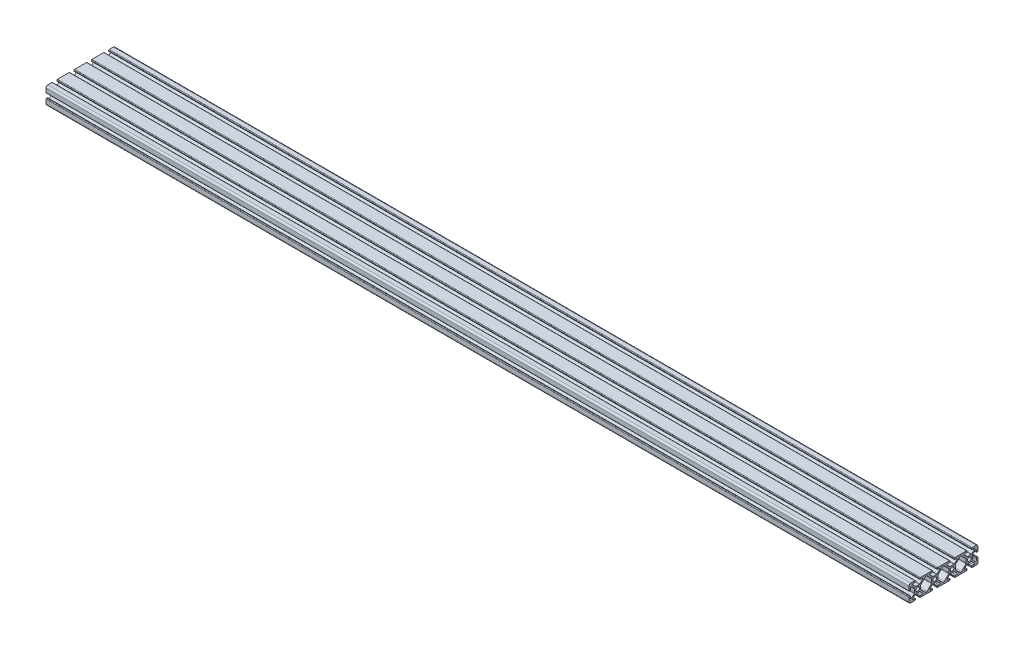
from build123d import *

# Parameters (mm, degrees)
MODEL_R                = 2.15
STRUKTURBAUTEIL1_DEPTH = 1000


with BuildPart() as part:
    # Model → Strukturbauteil1 (new body)
    with BuildSketch(Plane(origin=(0, 0, 0), x_dir=(0, 0, -1), z_dir=(1, 0, 0))):
        with BuildLine():
            Line((-40, -3.2), (-40, -8))
            ThreePointArc((-40, -8), (-39.414213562, -9.414213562), (-38, -10))
            Line((-38, -10), (-33.2, -10))
            ThreePointArc((-33.2, -10), (-32.705025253, -9.794974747), (-32.5, -9.3))
            Line((-32.5, -9.3), (-32.5, -8.7))
            ThreePointArc((-32.5, -8.7), (-32.646446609, -8.346446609), (-33, -8.2))
            Line((-33, -8.2), (-34.867588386, -8.2))
            ThreePointArc((-34.867588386, -8.2), (-35.682830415, -7.655272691), (-35.491547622, -6.69362915))
            Line((-35.491547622, -6.69362915), (-32.740811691, -3.942893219))
            ThreePointArc((-32.740811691, -3.942893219), (-32.416388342, -3.726120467), (-32.03370491, -3.65))
            Line((-32.03370491, -3.65), (-27.96629509, -3.65))
            ThreePointArc((-27.96629509, -3.65), (-27.583611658, -3.726120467), (-27.259188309, -3.942893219))
            Line((-27.259188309, -3.942893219), (-24.508452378, -6.69362915))
            ThreePointArc((-24.508452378, -6.69362915), (-24.317169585, -7.655272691), (-25.132411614, -8.2))
            Line((-25.132411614, -8.2), (-27, -8.2))
            ThreePointArc((-27, -8.2), (-27.353553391, -8.346446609), (-27.5, -8.7))
            Line((-27.5, -8.7), (-27.5, -9.3))
            ThreePointArc((-27.5, -9.3), (-27.294974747, -9.794974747), (-26.8, -10))
            Line((-26.8, -10), (-13.2, -10))
            ThreePointArc((-13.2, -10), (-12.705025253, -9.794974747), (-12.5, -9.3))
            Line((-12.5, -9.3), (-12.5, -8.7))
            ThreePointArc((-12.5, -8.7), (-12.646446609, -8.346446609), (-13, -8.2))
            Line((-13, -8.2), (-14.867588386, -8.2))
            ThreePointArc((-14.867588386, -8.2), (-15.682830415, -7.655272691), (-15.491547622, -6.69362915))
            Line((-15.491547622, -6.69362915), (-12.740811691, -3.942893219))
            ThreePointArc((-12.740811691, -3.942893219), (-12.416388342, -3.726120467), (-12.03370491, -3.65))
            Line((-12.03370491, -3.65), (-7.96629509, -3.65))
            ThreePointArc((-7.96629509, -3.65), (-7.583611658, -3.726120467), (-7.259188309, -3.942893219))
            Line((-7.259188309, -3.942893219), (-4.508452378, -6.69362915))
            ThreePointArc((-4.508452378, -6.69362915), (-4.317169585, -7.655272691), (-5.132411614, -8.2))
            Line((-5.132411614, -8.2), (-7, -8.2))
            ThreePointArc((-7, -8.2), (-7.353553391, -8.346446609), (-7.5, -8.7))
            Line((-7.5, -8.7), (-7.5, -9.3))
            ThreePointArc((-7.5, -9.3), (-7.294974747, -9.794974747), (-6.8, -10))
            Line((-6.8, -10), (6.8, -10))
            ThreePointArc((6.8, -10), (7.294974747, -9.794974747), (7.5, -9.3))
            Line((7.5, -9.3), (7.5, -8.7))
            ThreePointArc((7.5, -8.7), (7.353553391, -8.346446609), (7, -8.2))
            Line((7, -8.2), (5.132411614, -8.2))
            ThreePointArc((5.132411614, -8.2), (4.317169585, -7.655272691), (4.508452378, -6.69362915))
            Line((4.508452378, -6.69362915), (7.259188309, -3.942893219))
            ThreePointArc((7.259188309, -3.942893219), (7.583611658, -3.726120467), (7.96629509, -3.65))
            Line((7.96629509, -3.65), (12.03370491, -3.65))
            ThreePointArc((12.03370491, -3.65), (12.416388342, -3.726120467), (12.740811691, -3.942893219))
            Line((12.740811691, -3.942893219), (15.491547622, -6.69362915))
            ThreePointArc((15.491547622, -6.69362915), (15.682830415, -7.655272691), (14.867588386, -8.2))
            Line((14.867588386, -8.2), (13, -8.2))
            ThreePointArc((13, -8.2), (12.646446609, -8.346446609), (12.5, -8.7))
            Line((12.5, -8.7), (12.5, -9.3))
            ThreePointArc((12.5, -9.3), (12.705025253, -9.794974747), (13.2, -10))
            Line((13.2, -10), (26.8, -10))
            ThreePointArc((26.8, -10), (27.294974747, -9.794974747), (27.5, -9.3))
            Line((27.5, -9.3), (27.5, -8.7))
            ThreePointArc((27.5, -8.7), (27.353553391, -8.346446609), (27, -8.2))
            Line((27, -8.2), (25.132411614, -8.2))
            ThreePointArc((25.132411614, -8.2), (24.317169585, -7.655272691), (24.508452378, -6.69362915))
            Line((24.508452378, -6.69362915), (27.259188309, -3.942893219))
            ThreePointArc((27.259188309, -3.942893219), (27.583611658, -3.726120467), (27.96629509, -3.65))
            Line((27.96629509, -3.65), (32.03370491, -3.65))
            ThreePointArc((32.03370491, -3.65), (32.416388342, -3.726120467), (32.740811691, -3.942893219))
            Line((32.740811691, -3.942893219), (35.491547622, -6.69362915))
            ThreePointArc((35.491547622, -6.69362915), (35.682830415, -7.655272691), (34.867588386, -8.2))
            Line((34.867588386, -8.2), (33, -8.2))
            ThreePointArc((33, -8.2), (32.646446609, -8.346446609), (32.5, -8.7))
            Line((32.5, -8.7), (32.5, -9.3))
            ThreePointArc((32.5, -9.3), (32.705025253, -9.794974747), (33.2, -10))
            Line((33.2, -10), (38, -10))
            ThreePointArc((38, -10), (39.414213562, -9.414213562), (40, -8))
            Line((40, -8), (40, -3.2))
            ThreePointArc((40, -3.2), (39.794974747, -2.705025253), (39.3, -2.5))
            Line((39.3, -2.5), (38.7, -2.5))
            ThreePointArc((38.7, -2.5), (38.346446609, -2.646446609), (38.2, -3))
            Line((38.2, -3), (38.2, -4.867588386))
            ThreePointArc((38.2, -4.867588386), (37.655272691, -5.682830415), (36.69362915, -5.491547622))
            Line((36.69362915, -5.491547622), (33.942893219, -2.740811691))
            ThreePointArc((33.942893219, -2.740811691), (33.726120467, -2.416388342), (33.65, -2.03370491))
            Line((33.65, -2.03370491), (33.65, 2.03370491))
            ThreePointArc((33.65, 2.03370491), (33.726120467, 2.416388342), (33.942893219, 2.740811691))
            Line((33.942893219, 2.740811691), (36.69362915, 5.491547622))
            ThreePointArc((36.69362915, 5.491547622), (37.655272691, 5.682830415), (38.2, 4.867588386))
            Line((38.2, 4.867588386), (38.2, 3))
            ThreePointArc((38.2, 3), (38.346446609, 2.646446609), (38.7, 2.5))
            Line((38.7, 2.5), (39.3, 2.5))
            ThreePointArc((39.3, 2.5), (39.794974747, 2.705025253), (40, 3.2))
            Line((40, 3.2), (40, 8))
            ThreePointArc((40, 8), (39.414213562, 9.414213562), (38, 10))
            Line((38, 10), (33.2, 10))
            ThreePointArc((33.2, 10), (32.705025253, 9.794974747), (32.5, 9.3))
            Line((32.5, 9.3), (32.5, 8.7))
            ThreePointArc((32.5, 8.7), (32.646446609, 8.346446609), (33, 8.2))
            Line((33, 8.2), (34.867588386, 8.2))
            ThreePointArc((34.867588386, 8.2), (35.682830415, 7.655272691), (35.491547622, 6.69362915))
            Line((35.491547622, 6.69362915), (32.740811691, 3.942893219))
            ThreePointArc((32.740811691, 3.942893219), (32.416388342, 3.726120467), (32.03370491, 3.65))
            Line((32.03370491, 3.65), (27.96629509, 3.65))
            ThreePointArc((27.96629509, 3.65), (27.583611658, 3.726120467), (27.259188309, 3.942893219))
            Line((27.259188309, 3.942893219), (24.508452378, 6.69362915))
            ThreePointArc((24.508452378, 6.69362915), (24.317169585, 7.655272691), (25.132411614, 8.2))
            Line((25.132411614, 8.2), (27, 8.2))
            ThreePointArc((27, 8.2), (27.353553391, 8.346446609), (27.5, 8.7))
            Line((27.5, 8.7), (27.5, 9.3))
            ThreePointArc((27.5, 9.3), (27.294974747, 9.794974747), (26.8, 10))
            Line((26.8, 10), (13.2, 10))
            ThreePointArc((13.2, 10), (12.705025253, 9.794974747), (12.5, 9.3))
            Line((12.5, 9.3), (12.5, 8.7))
            ThreePointArc((12.5, 8.7), (12.646446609, 8.346446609), (13, 8.2))
            Line((13, 8.2), (14.867588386, 8.2))
            ThreePointArc((14.867588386, 8.2), (15.682830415, 7.655272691), (15.491547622, 6.69362915))
            Line((15.491547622, 6.69362915), (12.740811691, 3.942893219))
            ThreePointArc((12.740811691, 3.942893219), (12.416388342, 3.726120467), (12.03370491, 3.65))
            Line((12.03370491, 3.65), (7.96629509, 3.65))
            ThreePointArc((7.96629509, 3.65), (7.583611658, 3.726120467), (7.259188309, 3.942893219))
            Line((7.259188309, 3.942893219), (4.508452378, 6.69362915))
            ThreePointArc((4.508452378, 6.69362915), (4.317169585, 7.655272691), (5.132411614, 8.2))
            Line((5.132411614, 8.2), (7, 8.2))
            ThreePointArc((7, 8.2), (7.353553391, 8.346446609), (7.5, 8.7))
            Line((7.5, 8.7), (7.5, 9.3))
            ThreePointArc((7.5, 9.3), (7.294974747, 9.794974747), (6.8, 10))
            Line((6.8, 10), (-6.8, 10))
            ThreePointArc((-6.8, 10), (-7.294974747, 9.794974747), (-7.5, 9.3))
            Line((-7.5, 9.3), (-7.5, 8.7))
            ThreePointArc((-7.5, 8.7), (-7.353553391, 8.346446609), (-7, 8.2))
            Line((-7, 8.2), (-5.132411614, 8.2))
            ThreePointArc((-5.132411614, 8.2), (-4.317169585, 7.655272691), (-4.508452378, 6.69362915))
            Line((-4.508452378, 6.69362915), (-7.259188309, 3.942893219))
            ThreePointArc((-7.259188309, 3.942893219), (-7.583611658, 3.726120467), (-7.96629509, 3.65))
            Line((-7.96629509, 3.65), (-12.03370491, 3.65))
            ThreePointArc((-12.03370491, 3.65), (-12.416388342, 3.726120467), (-12.740811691, 3.942893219))
            Line((-12.740811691, 3.942893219), (-15.491547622, 6.69362915))
            ThreePointArc((-15.491547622, 6.69362915), (-15.682830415, 7.655272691), (-14.867588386, 8.2))
            Line((-14.867588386, 8.2), (-13, 8.2))
            ThreePointArc((-13, 8.2), (-12.646446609, 8.346446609), (-12.5, 8.7))
            Line((-12.5, 8.7), (-12.5, 9.3))
            ThreePointArc((-12.5, 9.3), (-12.705025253, 9.794974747), (-13.2, 10))
            Line((-13.2, 10), (-26.8, 10))
            ThreePointArc((-26.8, 10), (-27.294974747, 9.794974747), (-27.5, 9.3))
            Line((-27.5, 9.3), (-27.5, 8.7))
            ThreePointArc((-27.5, 8.7), (-27.353553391, 8.346446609), (-27, 8.2))
            Line((-27, 8.2), (-25.132411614, 8.2))
            ThreePointArc((-25.132411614, 8.2), (-24.317169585, 7.655272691), (-24.508452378, 6.69362915))
            Line((-24.508452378, 6.69362915), (-27.259188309, 3.942893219))
            ThreePointArc((-27.259188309, 3.942893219), (-27.583611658, 3.726120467), (-27.96629509, 3.65))
            Line((-27.96629509, 3.65), (-32.03370491, 3.65))
            ThreePointArc((-32.03370491, 3.65), (-32.416388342, 3.726120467), (-32.740811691, 3.942893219))
            Line((-32.740811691, 3.942893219), (-35.491547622, 6.69362915))
            ThreePointArc((-35.491547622, 6.69362915), (-35.682830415, 7.655272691), (-34.867588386, 8.2))
            Line((-34.867588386, 8.2), (-33, 8.2))
            ThreePointArc((-33, 8.2), (-32.646446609, 8.346446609), (-32.5, 8.7))
            Line((-32.5, 8.7), (-32.5, 9.3))
            ThreePointArc((-32.5, 9.3), (-32.705025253, 9.794974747), (-33.2, 10))
            Line((-33.2, 10), (-38, 10))
            ThreePointArc((-38, 10), (-39.414213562, 9.414213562), (-40, 8))
            Line((-40, 8), (-40, 3.2))
            ThreePointArc((-40, 3.2), (-39.794974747, 2.705025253), (-39.3, 2.5))
            Line((-39.3, 2.5), (-38.7, 2.5))
            ThreePointArc((-38.7, 2.5), (-38.346446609, 2.646446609), (-38.2, 3))
            Line((-38.2, 3), (-38.2, 4.867588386))
            ThreePointArc((-38.2, 4.867588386), (-37.655272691, 5.682830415), (-36.69362915, 5.491547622))
            Line((-36.69362915, 5.491547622), (-33.942893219, 2.740811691))
            ThreePointArc((-33.942893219, 2.740811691), (-33.726120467, 2.416388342), (-33.65, 2.03370491))
            Line((-33.65, 2.03370491), (-33.65, -2.03370491))
            ThreePointArc((-33.65, -2.03370491), (-33.726120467, -2.416388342), (-33.942893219, -2.740811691))
            Line((-33.942893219, -2.740811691), (-36.69362915, -5.491547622))
            ThreePointArc((-36.69362915, -5.491547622), (-37.655272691, -5.682830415), (-38.2, -4.867588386))
            Line((-38.2, -4.867588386), (-38.2, -3))
            ThreePointArc((-38.2, -3), (-38.346446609, -2.646446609), (-38.7, -2.5))
            Line((-38.7, -2.5), (-39.3, -2.5))
            ThreePointArc((-39.3, -2.5), (-39.794974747, -2.705025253), (-40, -3.2))
        make_face()
        with Locations((-30, 0)):
            Circle(MODEL_R, mode=Mode.SUBTRACT)
        with Locations((-10, 0)):
            Circle(MODEL_R, mode=Mode.SUBTRACT)
        with Locations((30, 0)):
            Circle(MODEL_R, mode=Mode.SUBTRACT)
        with Locations((10, 0)):
            Circle(MODEL_R, mode=Mode.SUBTRACT)
        with BuildLine():
            Line((-26.35, -2.03370491), (-26.35, 2.03370491))
            ThreePointArc((-26.35, 2.03370491), (-26.273879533, 2.416388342), (-26.057106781, 2.740811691))
            Line((-26.057106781, 2.740811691), (-21.020710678, 7.777207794))
            ThreePointArc((-21.020710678, 7.777207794), (-20, 8.2), (-18.979289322, 7.777207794))
            Line((-18.979289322, 7.777207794), (-13.942893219, 2.740811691))
            ThreePointArc((-13.942893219, 2.740811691), (-13.726120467, 2.416388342), (-13.65, 2.03370491))
            Line((-13.65, 2.03370491), (-13.65, -2.03370491))
            ThreePointArc((-13.65, -2.03370491), (-13.726120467, -2.416388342), (-13.942893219, -2.740811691))
            Line((-13.942893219, -2.740811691), (-18.979289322, -7.777207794))
            ThreePointArc((-18.979289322, -7.777207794), (-20, -8.2), (-21.020710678, -7.777207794))
            Line((-21.020710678, -7.777207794), (-26.057106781, -2.740811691))
            ThreePointArc((-26.057106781, -2.740811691), (-26.273879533, -2.416388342), (-26.35, -2.03370491))
        make_face(mode=Mode.SUBTRACT)
        with BuildLine():
            Line((13.65, -2.03370491), (13.65, 2.03370491))
            ThreePointArc((13.65, 2.03370491), (13.726120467, 2.416388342), (13.942893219, 2.740811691))
            Line((13.942893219, 2.740811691), (18.979289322, 7.777207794))
            ThreePointArc((18.979289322, 7.777207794), (20, 8.2), (21.020710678, 7.777207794))
            Line((21.020710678, 7.777207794), (26.057106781, 2.740811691))
            ThreePointArc((26.057106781, 2.740811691), (26.273879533, 2.416388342), (26.35, 2.03370491))
            Line((26.35, 2.03370491), (26.35, -2.03370491))
            ThreePointArc((26.35, -2.03370491), (26.273879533, -2.416388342), (26.057106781, -2.740811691))
            Line((26.057106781, -2.740811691), (21.020710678, -7.777207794))
            ThreePointArc((21.020710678, -7.777207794), (20, -8.2), (18.979289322, -7.777207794))
            Line((18.979289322, -7.777207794), (13.942893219, -2.740811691))
            ThreePointArc((13.942893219, -2.740811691), (13.726120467, -2.416388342), (13.65, -2.03370491))
        make_face(mode=Mode.SUBTRACT)
        with BuildLine():
            Line((-6.35, -2.03370491), (-6.35, 2.03370491))
            ThreePointArc((-6.35, 2.03370491), (-6.273879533, 2.416388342), (-6.057106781, 2.740811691))
            Line((-6.057106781, 2.740811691), (-1.020710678, 7.777207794))
            ThreePointArc((-1.020710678, 7.777207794), (0, 8.2), (1.020710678, 7.777207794))
            Line((1.020710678, 7.777207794), (6.057106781, 2.740811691))
            ThreePointArc((6.057106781, 2.740811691), (6.273879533, 2.416388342), (6.35, 2.03370491))
            Line((6.35, 2.03370491), (6.35, -2.03370491))
            ThreePointArc((6.35, -2.03370491), (6.273879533, -2.416388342), (6.057106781, -2.740811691))
            Line((6.057106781, -2.740811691), (1.020710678, -7.777207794))
            ThreePointArc((1.020710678, -7.777207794), (0, -8.2), (-1.020710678, -7.777207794))
            Line((-1.020710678, -7.777207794), (-6.057106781, -2.740811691))
            ThreePointArc((-6.057106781, -2.740811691), (-6.273879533, -2.416388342), (-6.35, -2.03370491))
        make_face(mode=Mode.SUBTRACT)
    extrude(amount=STRUKTURBAUTEIL1_DEPTH)


solid = part.part
